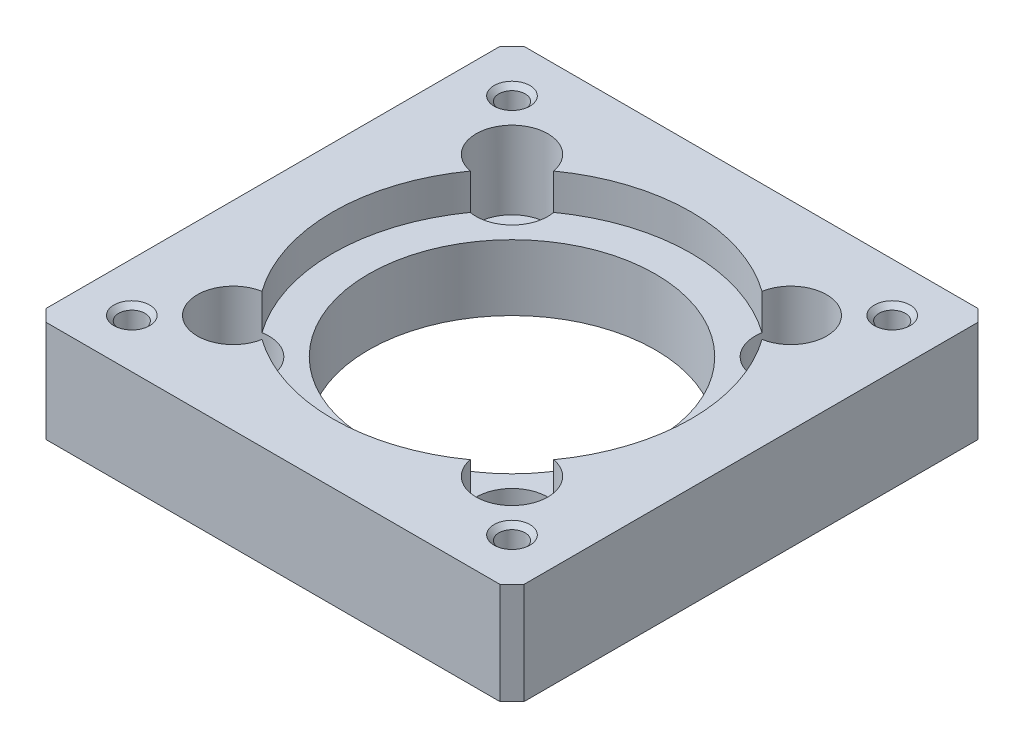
ISO-10303-21;
HEADER;
FILE_DESCRIPTION(('STEP AP214'),'2;1');
FILE_NAME('part.step','',(''),(''),'','','');
FILE_SCHEMA(('AUTOMOTIVE_DESIGN { 1 0 10303 214 1 1 1 1 }'));
ENDSEC;
DATA;
#1=APPLICATION_CONTEXT('core data for automotive mechanical design processes');
#2=APPLICATION_PROTOCOL_DEFINITION('international standard','automotive_design',2000,#1);
#3=PRODUCT_CONTEXT('',#1,'mechanical');
#4=PRODUCT('Part','Part','',(#3));
#5=PRODUCT_RELATED_PRODUCT_CATEGORY('part','',(#4));
#6=PRODUCT_DEFINITION_FORMATION('','',#4);
#7=PRODUCT_DEFINITION_CONTEXT('part definition',#1,'design');
#8=PRODUCT_DEFINITION('design','',#6,#7);
#9=PRODUCT_DEFINITION_SHAPE('','',#8);
#10=(LENGTH_UNIT() NAMED_UNIT(*) SI_UNIT(.MILLI.,.METRE.));
#11=(NAMED_UNIT(*) PLANE_ANGLE_UNIT() SI_UNIT($,.RADIAN.));
#12=(NAMED_UNIT(*) SI_UNIT($,.STERADIAN.) SOLID_ANGLE_UNIT());
#13=UNCERTAINTY_MEASURE_WITH_UNIT(LENGTH_MEASURE(1.E-05),#10,'distance_accuracy_value','');
#14=(GEOMETRIC_REPRESENTATION_CONTEXT(3) GLOBAL_UNCERTAINTY_ASSIGNED_CONTEXT((#13)) GLOBAL_UNIT_ASSIGNED_CONTEXT((#10,
#11,#12)) REPRESENTATION_CONTEXT('',''));
#15=CARTESIAN_POINT('',(0.,0.,0.));
#16=DIRECTION('',(0.,0.,1.));
#17=DIRECTION('',(1.,0.,0.));
#18=AXIS2_PLACEMENT_3D('',#15,#16,#17);
#19=CARTESIAN_POINT('',(-15.9099025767,8.10000000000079,15.9099025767));
#20=DIRECTION('',(0.,1.,0.));
#21=DIRECTION('',(0.,0.,1.));
#22=AXIS2_PLACEMENT_3D('',#19,#20,#21);
#23=CONICAL_SURFACE('',#22,1.09999999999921,0.785398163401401);
#24=CARTESIAN_POINT('',(-15.9099025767,8.1,15.9099025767));
#25=DIRECTION('',(0.,1.,0.));
#26=DIRECTION('',(1.,0.,0.));
#27=AXIS2_PLACEMENT_3D('',#24,#25,#26);
#28=CIRCLE('',#27,1.1);
#29=CARTESIAN_POINT('',(-14.8099025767,8.1,15.9099025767));
#30=VERTEX_POINT('',#29);
#31=EDGE_CURVE('E238',#30,#30,#28,.F.);
#32=ORIENTED_EDGE('',*,*,#31,.T.);
#33=EDGE_LOOP('',(#32));
#34=FACE_BOUND('',#33,.T.);
#35=CARTESIAN_POINT('',(-15.9099025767,8.49999999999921,15.9099025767));
#36=DIRECTION('',(0.,1.,0.));
#37=DIRECTION('',(0.,0.,1.));
#38=AXIS2_PLACEMENT_3D('',#35,#36,#37);
#39=CIRCLE('',#38,1.50000000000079);
#40=CARTESIAN_POINT('',(-15.9099025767,8.49999999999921,17.4099025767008));
#41=VERTEX_POINT('',#40);
#42=EDGE_CURVE('E266',#41,#41,#39,.T.);
#43=ORIENTED_EDGE('',*,*,#42,.T.);
#44=EDGE_LOOP('',(#43));
#45=FACE_BOUND('',#44,.T.);
#46=ADVANCED_FACE('F16',(#34,#45),#23,.F.);
#47=CARTESIAN_POINT('',(15.9099025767,8.10000000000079,15.9099025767));
#48=DIRECTION('',(0.,1.,0.));
#49=DIRECTION('',(0.,0.,1.));
#50=AXIS2_PLACEMENT_3D('',#47,#48,#49);
#51=CONICAL_SURFACE('',#50,1.09999999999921,0.785398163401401);
#52=CARTESIAN_POINT('',(15.9099025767,8.1,15.9099025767));
#53=DIRECTION('',(0.,1.,0.));
#54=DIRECTION('',(1.,0.,0.));
#55=AXIS2_PLACEMENT_3D('',#52,#53,#54);
#56=CIRCLE('',#55,1.1);
#57=CARTESIAN_POINT('',(17.0099025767,8.1,15.9099025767));
#58=VERTEX_POINT('',#57);
#59=EDGE_CURVE('E336',#58,#58,#56,.F.);
#60=ORIENTED_EDGE('',*,*,#59,.T.);
#61=EDGE_LOOP('',(#60));
#62=FACE_BOUND('',#61,.T.);
#63=CARTESIAN_POINT('',(15.9099025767,8.49999999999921,15.9099025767));
#64=DIRECTION('',(0.,1.,0.));
#65=DIRECTION('',(0.,0.,1.));
#66=AXIS2_PLACEMENT_3D('',#63,#64,#65);
#67=CIRCLE('',#66,1.5000000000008);
#68=CARTESIAN_POINT('',(15.9099025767,8.49999999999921,17.4099025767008));
#69=VERTEX_POINT('',#68);
#70=EDGE_CURVE('E263',#69,#69,#67,.T.);
#71=ORIENTED_EDGE('',*,*,#70,.T.);
#72=EDGE_LOOP('',(#71));
#73=FACE_BOUND('',#72,.T.);
#74=ADVANCED_FACE('F437',(#62,#73),#51,.F.);
#75=CARTESIAN_POINT('',(15.9099025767,8.10000000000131,-15.9099025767));
#76=DIRECTION('',(0.,1.,0.));
#77=DIRECTION('',(0.,0.,1.));
#78=AXIS2_PLACEMENT_3D('',#75,#76,#77);
#79=CONICAL_SURFACE('',#78,1.09999999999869,0.785398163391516);
#80=CARTESIAN_POINT('',(15.9099025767,8.1,-15.9099025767));
#81=DIRECTION('',(0.,1.,0.));
#82=DIRECTION('',(1.,0.,0.));
#83=AXIS2_PLACEMENT_3D('',#80,#81,#82);
#84=CIRCLE('',#83,1.1);
#85=CARTESIAN_POINT('',(17.0099025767,8.1,-15.9099025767));
#86=VERTEX_POINT('',#85);
#87=EDGE_CURVE('E333',#86,#86,#84,.F.);
#88=ORIENTED_EDGE('',*,*,#87,.T.);
#89=EDGE_LOOP('',(#88));
#90=FACE_BOUND('',#89,.T.);
#91=CARTESIAN_POINT('',(15.9099025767,8.50000000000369,-15.9099025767));
#92=DIRECTION('',(0.,1.,0.));
#93=DIRECTION('',(0.,0.,1.));
#94=AXIS2_PLACEMENT_3D('',#91,#92,#93);
#95=CIRCLE('',#94,1.49999999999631);
#96=CARTESIAN_POINT('',(15.9099025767,8.50000000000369,-14.4099025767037));
#97=VERTEX_POINT('',#96);
#98=EDGE_CURVE('E269',#97,#97,#95,.T.);
#99=ORIENTED_EDGE('',*,*,#98,.T.);
#100=EDGE_LOOP('',(#99));
#101=FACE_BOUND('',#100,.T.);
#102=ADVANCED_FACE('F441',(#90,#101),#79,.F.);
#103=CARTESIAN_POINT('',(-15.9099025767,8.10000000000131,-15.9099025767));
#104=DIRECTION('',(0.,1.,0.));
#105=DIRECTION('',(0.,0.,1.));
#106=AXIS2_PLACEMENT_3D('',#103,#104,#105);
#107=CONICAL_SURFACE('',#106,1.09999999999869,0.785398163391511);
#108=CARTESIAN_POINT('',(-15.9099025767,8.1,-15.9099025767));
#109=DIRECTION('',(0.,1.,0.));
#110=DIRECTION('',(1.,0.,0.));
#111=AXIS2_PLACEMENT_3D('',#108,#109,#110);
#112=CIRCLE('',#111,1.1);
#113=CARTESIAN_POINT('',(-14.8099025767,8.1,-15.9099025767));
#114=VERTEX_POINT('',#113);
#115=EDGE_CURVE('E234',#114,#114,#112,.F.);
#116=ORIENTED_EDGE('',*,*,#115,.T.);
#117=EDGE_LOOP('',(#116));
#118=FACE_BOUND('',#117,.T.);
#119=CARTESIAN_POINT('',(-15.9099025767,8.50000000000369,-15.9099025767));
#120=DIRECTION('',(0.,1.,0.));
#121=DIRECTION('',(0.,0.,1.));
#122=AXIS2_PLACEMENT_3D('',#119,#120,#121);
#123=CIRCLE('',#122,1.49999999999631);
#124=CARTESIAN_POINT('',(-15.9099025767,8.50000000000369,-14.4099025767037));
#125=VERTEX_POINT('',#124);
#126=EDGE_CURVE('E260',#125,#125,#123,.T.);
#127=ORIENTED_EDGE('',*,*,#126,.T.);
#128=EDGE_LOOP('',(#127));
#129=FACE_BOUND('',#128,.T.);
#130=ADVANCED_FACE('F445',(#118,#129),#107,.F.);
#131=CARTESIAN_POINT('',(0.,5.5,0.));
#132=DIRECTION('',(0.,1.,0.));
#133=DIRECTION('',(0.,0.,1.));
#134=AXIS2_PLACEMENT_3D('',#131,#132,#133);
#135=CYLINDRICAL_SURFACE('',#134,15.);
#136=CARTESIAN_POINT('',(0.,5.5,0.));
#137=DIRECTION('',(0.,1.,0.));
#138=DIRECTION('',(0.,0.,1.));
#139=AXIS2_PLACEMENT_3D('',#136,#137,#138);
#140=CIRCLE('',#139,15.);
#141=CARTESIAN_POINT('',(12.2076072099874,5.5,-8.71632526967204));
#142=VERTEX_POINT('',#141);
#143=CARTESIAN_POINT('',(12.2076072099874,5.5,8.71632526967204));
#144=VERTEX_POINT('',#143);
#145=EDGE_CURVE('E228',#142,#144,#140,.F.);
#146=ORIENTED_EDGE('',*,*,#145,.T.);
#147=DIRECTION('',(0.,-1.,0.));
#148=VECTOR('',#147,1.);
#149=CARTESIAN_POINT('',(12.2076072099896,5.25,8.71632526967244));
#150=LINE('',#149,#148);
#151=CARTESIAN_POINT('',(12.2076072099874,8.5,8.71632526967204));
#152=VERTEX_POINT('',#151);
#153=EDGE_CURVE('E324',#144,#152,#150,.F.);
#154=ORIENTED_EDGE('',*,*,#153,.T.);
#155=CARTESIAN_POINT('',(0.,8.5,0.));
#156=DIRECTION('',(0.,1.,0.));
#157=DIRECTION('',(0.,0.,1.));
#158=AXIS2_PLACEMENT_3D('',#155,#156,#157);
#159=CIRCLE('',#158,15.);
#160=CARTESIAN_POINT('',(12.2076072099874,8.5,-8.71632526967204));
#161=VERTEX_POINT('',#160);
#162=EDGE_CURVE('E257',#152,#161,#159,.T.);
#163=ORIENTED_EDGE('',*,*,#162,.T.);
#164=DIRECTION('',(0.,1.,0.));
#165=VECTOR('',#164,1.);
#166=CARTESIAN_POINT('',(12.2076072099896,5.25,-8.71632526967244));
#167=LINE('',#166,#165);
#168=EDGE_CURVE('E327',#161,#142,#167,.F.);
#169=ORIENTED_EDGE('',*,*,#168,.T.);
#170=EDGE_LOOP('',(#146,#154,#163,#169));
#171=FACE_BOUND('',#170,.T.);
#172=ADVANCED_FACE('F449',(#171),#135,.F.);
#173=CARTESIAN_POINT('',(0.,5.5,0.));
#174=DIRECTION('',(0.,1.,0.));
#175=DIRECTION('',(0.,0.,1.));
#176=AXIS2_PLACEMENT_3D('',#173,#174,#175);
#177=CYLINDRICAL_SURFACE('',#176,15.);
#178=CARTESIAN_POINT('',(0.,5.5,0.));
#179=DIRECTION('',(0.,1.,0.));
#180=DIRECTION('',(0.,0.,1.));
#181=AXIS2_PLACEMENT_3D('',#178,#179,#180);
#182=CIRCLE('',#181,15.);
#183=CARTESIAN_POINT('',(8.71632526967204,5.5,12.2076072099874));
#184=VERTEX_POINT('',#183);
#185=CARTESIAN_POINT('',(-8.71632526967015,5.5,12.2076072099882));
#186=VERTEX_POINT('',#185);
#187=EDGE_CURVE('E222',#184,#186,#182,.F.);
#188=ORIENTED_EDGE('',*,*,#187,.T.);
#189=DIRECTION('',(0.,-1.,0.));
#190=VECTOR('',#189,1.);
#191=CARTESIAN_POINT('',(-8.71632526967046,5.25,12.2076072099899));
#192=LINE('',#191,#190);
#193=CARTESIAN_POINT('',(-8.71632526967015,8.5,12.2076072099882));
#194=VERTEX_POINT('',#193);
#195=EDGE_CURVE('E314',#186,#194,#192,.F.);
#196=ORIENTED_EDGE('',*,*,#195,.T.);
#197=CARTESIAN_POINT('',(0.,8.5,0.));
#198=DIRECTION('',(0.,1.,0.));
#199=DIRECTION('',(0.,0.,1.));
#200=AXIS2_PLACEMENT_3D('',#197,#198,#199);
#201=CIRCLE('',#200,15.);
#202=CARTESIAN_POINT('',(8.71632526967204,8.5,12.2076072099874));
#203=VERTEX_POINT('',#202);
#204=EDGE_CURVE('E239',#194,#203,#201,.T.);
#205=ORIENTED_EDGE('',*,*,#204,.T.);
#206=DIRECTION('',(0.,1.,0.));
#207=VECTOR('',#206,1.);
#208=CARTESIAN_POINT('',(8.71632526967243,5.25,12.2076072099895));
#209=LINE('',#208,#207);
#210=EDGE_CURVE('E318',#203,#184,#209,.F.);
#211=ORIENTED_EDGE('',*,*,#210,.T.);
#212=EDGE_LOOP('',(#188,#196,#205,#211));
#213=FACE_BOUND('',#212,.T.);
#214=ADVANCED_FACE('F453',(#213),#177,.F.);
#215=CARTESIAN_POINT('',(0.,5.5,0.));
#216=DIRECTION('',(0.,1.,0.));
#217=DIRECTION('',(0.,0.,1.));
#218=AXIS2_PLACEMENT_3D('',#215,#216,#217);
#219=CYLINDRICAL_SURFACE('',#218,15.);
#220=CARTESIAN_POINT('',(0.,8.5,0.));
#221=DIRECTION('',(0.,1.,0.));
#222=DIRECTION('',(0.,0.,1.));
#223=AXIS2_PLACEMENT_3D('',#220,#221,#222);
#224=CIRCLE('',#223,15.);
#225=CARTESIAN_POINT('',(-12.2076072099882,8.5,-8.71632526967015));
#226=VERTEX_POINT('',#225);
#227=CARTESIAN_POINT('',(-12.2076072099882,8.5,8.71632526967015));
#228=VERTEX_POINT('',#227);
#229=EDGE_CURVE('E245',#226,#228,#224,.T.);
#230=ORIENTED_EDGE('',*,*,#229,.T.);
#231=DIRECTION('',(0.,1.,0.));
#232=VECTOR('',#231,1.);
#233=CARTESIAN_POINT('',(-12.2076072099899,5.25,8.71632526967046));
#234=LINE('',#233,#232);
#235=CARTESIAN_POINT('',(-12.2076072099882,5.5,8.71632526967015));
#236=VERTEX_POINT('',#235);
#237=EDGE_CURVE('E320',#228,#236,#234,.F.);
#238=ORIENTED_EDGE('',*,*,#237,.T.);
#239=CARTESIAN_POINT('',(0.,5.5,0.));
#240=DIRECTION('',(0.,1.,0.));
#241=DIRECTION('',(0.,0.,1.));
#242=AXIS2_PLACEMENT_3D('',#239,#240,#241);
#243=CIRCLE('',#242,15.);
#244=CARTESIAN_POINT('',(-12.2076072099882,5.5,-8.71632526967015));
#245=VERTEX_POINT('',#244);
#246=EDGE_CURVE('E216',#236,#245,#243,.F.);
#247=ORIENTED_EDGE('',*,*,#246,.T.);
#248=DIRECTION('',(0.,-1.,0.));
#249=VECTOR('',#248,1.);
#250=CARTESIAN_POINT('',(-12.2076072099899,5.25,-8.71632526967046));
#251=LINE('',#250,#249);
#252=EDGE_CURVE('E317',#245,#226,#251,.F.);
#253=ORIENTED_EDGE('',*,*,#252,.T.);
#254=EDGE_LOOP('',(#230,#238,#247,#253));
#255=FACE_BOUND('',#254,.T.);
#256=ADVANCED_FACE('F457',(#255),#219,.F.);
#257=CARTESIAN_POINT('',(0.,5.5,0.));
#258=DIRECTION('',(0.,1.,0.));
#259=DIRECTION('',(0.,0.,1.));
#260=AXIS2_PLACEMENT_3D('',#257,#258,#259);
#261=CYLINDRICAL_SURFACE('',#260,15.);
#262=CARTESIAN_POINT('',(0.,5.5,0.));
#263=DIRECTION('',(0.,1.,0.));
#264=DIRECTION('',(0.,0.,1.));
#265=AXIS2_PLACEMENT_3D('',#262,#263,#264);
#266=CIRCLE('',#265,15.);
#267=CARTESIAN_POINT('',(-8.71632526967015,5.5,-12.2076072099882));
#268=VERTEX_POINT('',#267);
#269=CARTESIAN_POINT('',(8.71632526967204,5.5,-12.2076072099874));
#270=VERTEX_POINT('',#269);
#271=EDGE_CURVE('E210',#268,#270,#266,.F.);
#272=ORIENTED_EDGE('',*,*,#271,.T.);
#273=DIRECTION('',(0.,-1.,0.));
#274=VECTOR('',#273,1.);
#275=CARTESIAN_POINT('',(8.71632526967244,5.25,-12.2076072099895));
#276=LINE('',#275,#274);
#277=CARTESIAN_POINT('',(8.71632526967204,8.5,-12.2076072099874));
#278=VERTEX_POINT('',#277);
#279=EDGE_CURVE('E329',#270,#278,#276,.F.);
#280=ORIENTED_EDGE('',*,*,#279,.T.);
#281=CARTESIAN_POINT('',(0.,8.5,0.));
#282=DIRECTION('',(0.,1.,0.));
#283=DIRECTION('',(0.,0.,1.));
#284=AXIS2_PLACEMENT_3D('',#281,#282,#283);
#285=CIRCLE('',#284,15.);
#286=CARTESIAN_POINT('',(-8.71632526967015,8.5,-12.2076072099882));
#287=VERTEX_POINT('',#286);
#288=EDGE_CURVE('E251',#278,#287,#285,.T.);
#289=ORIENTED_EDGE('',*,*,#288,.T.);
#290=DIRECTION('',(0.,1.,0.));
#291=VECTOR('',#290,1.);
#292=CARTESIAN_POINT('',(-8.71632526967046,5.25,-12.2076072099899));
#293=LINE('',#292,#291);
#294=EDGE_CURVE('E315',#287,#268,#293,.F.);
#295=ORIENTED_EDGE('',*,*,#294,.T.);
#296=EDGE_LOOP('',(#272,#280,#289,#295));
#297=FACE_BOUND('',#296,.T.);
#298=ADVANCED_FACE('F461',(#297),#261,.F.);
#299=CARTESIAN_POINT('',(11.66726188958,2.,-11.66726188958));
#300=DIRECTION('',(0.,1.,0.));
#301=DIRECTION('',(0.,0.,1.));
#302=AXIS2_PLACEMENT_3D('',#299,#300,#301);
#303=CYLINDRICAL_SURFACE('',#302,3.);
#304=CARTESIAN_POINT('',(11.66726188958,2.,-11.66726188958));
#305=DIRECTION('',(0.,1.,0.));
#306=DIRECTION('',(0.,0.,1.));
#307=AXIS2_PLACEMENT_3D('',#304,#305,#306);
#308=CIRCLE('',#307,3.);
#309=CARTESIAN_POINT('',(11.66726188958,2.,-8.66726188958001));
#310=VERTEX_POINT('',#309);
#311=EDGE_CURVE('E207',#310,#310,#308,.F.);
#312=ORIENTED_EDGE('',*,*,#311,.T.);
#313=EDGE_LOOP('',(#312));
#314=FACE_BOUND('',#313,.T.);
#315=ORIENTED_EDGE('',*,*,#168,.F.);
#316=CARTESIAN_POINT('',(11.66726188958,8.5,-11.66726188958));
#317=DIRECTION('',(0.,1.,0.));
#318=DIRECTION('',(0.,0.,1.));
#319=AXIS2_PLACEMENT_3D('',#316,#317,#318);
#320=CIRCLE('',#319,3.);
#321=EDGE_CURVE('E254',#161,#278,#320,.T.);
#322=ORIENTED_EDGE('',*,*,#321,.T.);
#323=ORIENTED_EDGE('',*,*,#279,.F.);
#324=CARTESIAN_POINT('',(11.66726188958,5.5,-11.66726188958));
#325=DIRECTION('',(0.,1.,0.));
#326=DIRECTION('',(0.,0.,1.));
#327=AXIS2_PLACEMENT_3D('',#324,#325,#326);
#328=CIRCLE('',#327,3.);
#329=EDGE_CURVE('E231',#270,#142,#328,.T.);
#330=ORIENTED_EDGE('',*,*,#329,.T.);
#331=EDGE_LOOP('',(#315,#322,#323,#330));
#332=FACE_BOUND('',#331,.T.);
#333=ADVANCED_FACE('F465',(#314,#332),#303,.F.);
#334=CARTESIAN_POINT('',(11.66726188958,2.,11.66726188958));
#335=DIRECTION('',(0.,1.,0.));
#336=DIRECTION('',(0.,0.,1.));
#337=AXIS2_PLACEMENT_3D('',#334,#335,#336);
#338=CYLINDRICAL_SURFACE('',#337,3.);
#339=CARTESIAN_POINT('',(11.66726188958,2.,11.66726188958));
#340=DIRECTION('',(0.,1.,0.));
#341=DIRECTION('',(0.,0.,1.));
#342=AXIS2_PLACEMENT_3D('',#339,#340,#341);
#343=CIRCLE('',#342,3.);
#344=CARTESIAN_POINT('',(11.66726188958,2.,14.66726188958));
#345=VERTEX_POINT('',#344);
#346=EDGE_CURVE('E204',#345,#345,#343,.F.);
#347=ORIENTED_EDGE('',*,*,#346,.T.);
#348=EDGE_LOOP('',(#347));
#349=FACE_BOUND('',#348,.T.);
#350=ORIENTED_EDGE('',*,*,#210,.F.);
#351=CARTESIAN_POINT('',(11.66726188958,8.5,11.66726188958));
#352=DIRECTION('',(0.,1.,0.));
#353=DIRECTION('',(0.,0.,1.));
#354=AXIS2_PLACEMENT_3D('',#351,#352,#353);
#355=CIRCLE('',#354,3.);
#356=EDGE_CURVE('E235',#203,#152,#355,.T.);
#357=ORIENTED_EDGE('',*,*,#356,.T.);
#358=ORIENTED_EDGE('',*,*,#153,.F.);
#359=CARTESIAN_POINT('',(11.66726188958,5.5,11.66726188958));
#360=DIRECTION('',(0.,1.,0.));
#361=DIRECTION('',(0.,0.,1.));
#362=AXIS2_PLACEMENT_3D('',#359,#360,#361);
#363=CIRCLE('',#362,3.);
#364=EDGE_CURVE('E225',#144,#184,#363,.T.);
#365=ORIENTED_EDGE('',*,*,#364,.T.);
#366=EDGE_LOOP('',(#350,#357,#358,#365));
#367=FACE_BOUND('',#366,.T.);
#368=ADVANCED_FACE('F469',(#349,#367),#338,.F.);
#369=CARTESIAN_POINT('',(-11.66726188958,2.,-11.66726188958));
#370=DIRECTION('',(0.,1.,0.));
#371=DIRECTION('',(0.,0.,1.));
#372=AXIS2_PLACEMENT_3D('',#369,#370,#371);
#373=CYLINDRICAL_SURFACE('',#372,3.000000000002);
#374=CARTESIAN_POINT('',(-11.66726188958,2.,-11.66726188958));
#375=DIRECTION('',(0.,1.,0.));
#376=DIRECTION('',(0.,0.,1.));
#377=AXIS2_PLACEMENT_3D('',#374,#375,#376);
#378=CIRCLE('',#377,3.000000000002);
#379=CARTESIAN_POINT('',(-11.66726188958,2.,-8.667261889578));
#380=VERTEX_POINT('',#379);
#381=EDGE_CURVE('E152',#380,#380,#378,.F.);
#382=ORIENTED_EDGE('',*,*,#381,.T.);
#383=EDGE_LOOP('',(#382));
#384=FACE_BOUND('',#383,.T.);
#385=ORIENTED_EDGE('',*,*,#294,.F.);
#386=CARTESIAN_POINT('',(-11.66726188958,8.5,-11.66726188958));
#387=DIRECTION('',(0.,1.,0.));
#388=DIRECTION('',(0.,0.,1.));
#389=AXIS2_PLACEMENT_3D('',#386,#387,#388);
#390=CIRCLE('',#389,3.000000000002);
#391=EDGE_CURVE('E248',#287,#226,#390,.T.);
#392=ORIENTED_EDGE('',*,*,#391,.T.);
#393=ORIENTED_EDGE('',*,*,#252,.F.);
#394=CARTESIAN_POINT('',(-11.66726188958,5.5,-11.66726188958));
#395=DIRECTION('',(0.,1.,0.));
#396=DIRECTION('',(0.,0.,1.));
#397=AXIS2_PLACEMENT_3D('',#394,#395,#396);
#398=CIRCLE('',#397,3.000000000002);
#399=EDGE_CURVE('E213',#245,#268,#398,.T.);
#400=ORIENTED_EDGE('',*,*,#399,.T.);
#401=EDGE_LOOP('',(#385,#392,#393,#400));
#402=FACE_BOUND('',#401,.T.);
#403=ADVANCED_FACE('F473',(#384,#402),#373,.F.);
#404=CARTESIAN_POINT('',(-11.66726188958,2.,11.66726188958));
#405=DIRECTION('',(0.,1.,0.));
#406=DIRECTION('',(0.,0.,1.));
#407=AXIS2_PLACEMENT_3D('',#404,#405,#406);
#408=CYLINDRICAL_SURFACE('',#407,3.000000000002);
#409=CARTESIAN_POINT('',(-11.66726188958,2.,11.66726188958));
#410=DIRECTION('',(0.,1.,0.));
#411=DIRECTION('',(0.,0.,1.));
#412=AXIS2_PLACEMENT_3D('',#409,#410,#411);
#413=CIRCLE('',#412,3.000000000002);
#414=CARTESIAN_POINT('',(-11.66726188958,2.,14.667261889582));
#415=VERTEX_POINT('',#414);
#416=EDGE_CURVE('E149',#415,#415,#413,.F.);
#417=ORIENTED_EDGE('',*,*,#416,.T.);
#418=EDGE_LOOP('',(#417));
#419=FACE_BOUND('',#418,.T.);
#420=ORIENTED_EDGE('',*,*,#237,.F.);
#421=CARTESIAN_POINT('',(-11.66726188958,8.5,11.66726188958));
#422=DIRECTION('',(0.,1.,0.));
#423=DIRECTION('',(0.,0.,1.));
#424=AXIS2_PLACEMENT_3D('',#421,#422,#423);
#425=CIRCLE('',#424,3.000000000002);
#426=EDGE_CURVE('E242',#228,#194,#425,.T.);
#427=ORIENTED_EDGE('',*,*,#426,.T.);
#428=ORIENTED_EDGE('',*,*,#195,.F.);
#429=CARTESIAN_POINT('',(-11.66726188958,5.5,11.66726188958));
#430=DIRECTION('',(0.,1.,0.));
#431=DIRECTION('',(0.,0.,1.));
#432=AXIS2_PLACEMENT_3D('',#429,#430,#431);
#433=CIRCLE('',#432,3.000000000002);
#434=EDGE_CURVE('E219',#186,#236,#433,.T.);
#435=ORIENTED_EDGE('',*,*,#434,.T.);
#436=EDGE_LOOP('',(#420,#427,#428,#435));
#437=FACE_BOUND('',#436,.T.);
#438=ADVANCED_FACE('F434',(#419,#437),#408,.F.);
#439=CARTESIAN_POINT('',(-20.0528,8.67,-18.9472));
#440=DIRECTION('',(-0.707106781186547,0.,-0.707106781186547));
#441=DIRECTION('',(0.707106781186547,0.,-0.707106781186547));
#442=AXIS2_PLACEMENT_3D('',#439,#440,#441);
#443=PLANE('',#442);
#444=DIRECTION('',(0.707106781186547,0.,-0.707106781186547));
#445=VECTOR('',#444,1.);
#446=CARTESIAN_POINT('',(-20.0528,8.5,-18.9472));
#447=LINE('',#446,#445);
#448=CARTESIAN_POINT('',(-20.,8.5,-19.));
#449=VERTEX_POINT('',#448);
#450=CARTESIAN_POINT('',(-19.,8.5,-20.));
#451=VERTEX_POINT('',#450);
#452=EDGE_CURVE('E272',#449,#451,#447,.T.);
#453=ORIENTED_EDGE('',*,*,#452,.T.);
#454=DIRECTION('',(0.,1.,0.));
#455=VECTOR('',#454,1.);
#456=CARTESIAN_POINT('',(-19.,4.25,-20.));
#457=LINE('',#456,#455);
#458=CARTESIAN_POINT('',(-19.,0.,-20.));
#459=VERTEX_POINT('',#458);
#460=EDGE_CURVE('E145',#451,#459,#457,.F.);
#461=ORIENTED_EDGE('',*,*,#460,.T.);
#462=DIRECTION('',(-0.707106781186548,0.,0.707106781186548));
#463=VECTOR('',#462,1.);
#464=CARTESIAN_POINT('',(-19.5,0.,-19.5));
#465=LINE('',#464,#463);
#466=CARTESIAN_POINT('',(-20.,0.,-19.));
#467=VERTEX_POINT('',#466);
#468=EDGE_CURVE('E312',#467,#459,#465,.F.);
#469=ORIENTED_EDGE('',*,*,#468,.F.);
#470=DIRECTION('',(0.,-1.,0.));
#471=VECTOR('',#470,1.);
#472=CARTESIAN_POINT('',(-20.,4.25,-19.));
#473=LINE('',#472,#471);
#474=EDGE_CURVE('E342',#467,#449,#473,.F.);
#475=ORIENTED_EDGE('',*,*,#474,.T.);
#476=EDGE_LOOP('',(#453,#461,#469,#475));
#477=FACE_BOUND('',#476,.T.);
#478=ADVANCED_FACE('F345',(#477),#443,.T.);
#479=CARTESIAN_POINT('',(-18.9472,8.67,20.0528));
#480=DIRECTION('',(-0.707106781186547,0.,0.707106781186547));
#481=DIRECTION('',(-0.707106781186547,0.,-0.707106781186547));
#482=AXIS2_PLACEMENT_3D('',#479,#480,#481);
#483=PLANE('',#482);
#484=DIRECTION('',(-0.707106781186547,0.,-0.707106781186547));
#485=VECTOR('',#484,1.);
#486=CARTESIAN_POINT('',(-18.9472,8.5,20.0528));
#487=LINE('',#486,#485);
#488=CARTESIAN_POINT('',(-19.,8.5,20.));
#489=VERTEX_POINT('',#488);
#490=CARTESIAN_POINT('',(-20.,8.5,19.));
#491=VERTEX_POINT('',#490);
#492=EDGE_CURVE('E274',#489,#491,#487,.T.);
#493=ORIENTED_EDGE('',*,*,#492,.T.);
#494=DIRECTION('',(0.,1.,0.));
#495=VECTOR('',#494,1.);
#496=CARTESIAN_POINT('',(-20.,4.25,19.));
#497=LINE('',#496,#495);
#498=CARTESIAN_POINT('',(-20.,0.,19.));
#499=VERTEX_POINT('',#498);
#500=EDGE_CURVE('E290',#491,#499,#497,.F.);
#501=ORIENTED_EDGE('',*,*,#500,.T.);
#502=DIRECTION('',(0.707106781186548,0.,0.707106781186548));
#503=VECTOR('',#502,1.);
#504=CARTESIAN_POINT('',(-19.5,0.,19.5));
#505=LINE('',#504,#503);
#506=CARTESIAN_POINT('',(-19.,0.,20.));
#507=VERTEX_POINT('',#506);
#508=EDGE_CURVE('E310',#507,#499,#505,.F.);
#509=ORIENTED_EDGE('',*,*,#508,.F.);
#510=DIRECTION('',(0.,-1.,0.));
#511=VECTOR('',#510,1.);
#512=CARTESIAN_POINT('',(-19.,4.25,20.));
#513=LINE('',#512,#511);
#514=EDGE_CURVE('E288',#507,#489,#513,.F.);
#515=ORIENTED_EDGE('',*,*,#514,.T.);
#516=EDGE_LOOP('',(#493,#501,#509,#515));
#517=FACE_BOUND('',#516,.T.);
#518=ADVANCED_FACE('F428',(#517),#483,.T.);
#519=CARTESIAN_POINT('',(18.9472,8.67,-20.0528));
#520=DIRECTION('',(0.707106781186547,0.,-0.707106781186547));
#521=DIRECTION('',(0.707106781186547,0.,0.707106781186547));
#522=AXIS2_PLACEMENT_3D('',#519,#520,#521);
#523=PLANE('',#522);
#524=DIRECTION('',(0.707106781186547,0.,0.707106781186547));
#525=VECTOR('',#524,1.);
#526=CARTESIAN_POINT('',(18.9472,8.5,-20.0528));
#527=LINE('',#526,#525);
#528=CARTESIAN_POINT('',(19.,8.5,-20.));
#529=VERTEX_POINT('',#528);
#530=CARTESIAN_POINT('',(20.,8.5,-19.));
#531=VERTEX_POINT('',#530);
#532=EDGE_CURVE('E20',#529,#531,#527,.T.);
#533=ORIENTED_EDGE('',*,*,#532,.T.);
#534=DIRECTION('',(0.,1.,0.));
#535=VECTOR('',#534,1.);
#536=CARTESIAN_POINT('',(20.,4.25,-19.));
#537=LINE('',#536,#535);
#538=CARTESIAN_POINT('',(20.,0.,-19.));
#539=VERTEX_POINT('',#538);
#540=EDGE_CURVE('E158',#531,#539,#537,.F.);
#541=ORIENTED_EDGE('',*,*,#540,.T.);
#542=DIRECTION('',(-0.707106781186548,0.,-0.707106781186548));
#543=VECTOR('',#542,1.);
#544=CARTESIAN_POINT('',(19.5,0.,-19.5));
#545=LINE('',#544,#543);
#546=CARTESIAN_POINT('',(19.,0.,-20.));
#547=VERTEX_POINT('',#546);
#548=EDGE_CURVE('E148',#547,#539,#545,.F.);
#549=ORIENTED_EDGE('',*,*,#548,.F.);
#550=DIRECTION('',(0.,-1.,0.));
#551=VECTOR('',#550,1.);
#552=CARTESIAN_POINT('',(19.,4.25,-20.));
#553=LINE('',#552,#551);
#554=EDGE_CURVE('E142',#547,#529,#553,.F.);
#555=ORIENTED_EDGE('',*,*,#554,.T.);
#556=EDGE_LOOP('',(#533,#541,#549,#555));
#557=FACE_BOUND('',#556,.T.);
#558=ADVANCED_FACE('F147',(#557),#523,.T.);
#559=CARTESIAN_POINT('',(20.0528,8.67,18.9472));
#560=DIRECTION('',(0.707106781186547,0.,0.707106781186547));
#561=DIRECTION('',(-0.707106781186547,0.,0.707106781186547));
#562=AXIS2_PLACEMENT_3D('',#559,#560,#561);
#563=PLANE('',#562);
#564=DIRECTION('',(-0.707106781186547,0.,0.707106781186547));
#565=VECTOR('',#564,1.);
#566=CARTESIAN_POINT('',(20.0528,8.5,18.9472));
#567=LINE('',#566,#565);
#568=CARTESIAN_POINT('',(20.,8.5,19.));
#569=VERTEX_POINT('',#568);
#570=CARTESIAN_POINT('',(19.,8.5,20.));
#571=VERTEX_POINT('',#570);
#572=EDGE_CURVE('E136',#569,#571,#567,.T.);
#573=ORIENTED_EDGE('',*,*,#572,.T.);
#574=DIRECTION('',(0.,1.,0.));
#575=VECTOR('',#574,1.);
#576=CARTESIAN_POINT('',(19.,4.25,20.));
#577=LINE('',#576,#575);
#578=CARTESIAN_POINT('',(19.,0.,20.));
#579=VERTEX_POINT('',#578);
#580=EDGE_CURVE('E156',#571,#579,#577,.F.);
#581=ORIENTED_EDGE('',*,*,#580,.T.);
#582=DIRECTION('',(0.707106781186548,0.,-0.707106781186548));
#583=VECTOR('',#582,1.);
#584=CARTESIAN_POINT('',(19.5,0.,19.5));
#585=LINE('',#584,#583);
#586=CARTESIAN_POINT('',(20.,0.,19.));
#587=VERTEX_POINT('',#586);
#588=EDGE_CURVE('E35',#587,#579,#585,.F.);
#589=ORIENTED_EDGE('',*,*,#588,.F.);
#590=DIRECTION('',(0.,-1.,0.));
#591=VECTOR('',#590,1.);
#592=CARTESIAN_POINT('',(20.,4.25,19.));
#593=LINE('',#592,#591);
#594=EDGE_CURVE('E159',#587,#569,#593,.F.);
#595=ORIENTED_EDGE('',*,*,#594,.T.);
#596=EDGE_LOOP('',(#573,#581,#589,#595));
#597=FACE_BOUND('',#596,.T.);
#598=ADVANCED_FACE('F276',(#597),#563,.T.);
#599=CARTESIAN_POINT('',(-20.8,8.5,20.8));
#600=DIRECTION('',(0.,1.,0.));
#601=DIRECTION('',(1.,0.,0.));
#602=AXIS2_PLACEMENT_3D('',#599,#600,#601);
#603=PLANE('',#602);
#604=ORIENTED_EDGE('',*,*,#356,.F.);
#605=ORIENTED_EDGE('',*,*,#204,.F.);
#606=ORIENTED_EDGE('',*,*,#426,.F.);
#607=ORIENTED_EDGE('',*,*,#229,.F.);
#608=ORIENTED_EDGE('',*,*,#391,.F.);
#609=ORIENTED_EDGE('',*,*,#288,.F.);
#610=ORIENTED_EDGE('',*,*,#321,.F.);
#611=ORIENTED_EDGE('',*,*,#162,.F.);
#612=EDGE_LOOP('',(#604,#605,#606,#607,#608,#609,#610,#611));
#613=FACE_BOUND('',#612,.T.);
#614=ORIENTED_EDGE('',*,*,#126,.F.);
#615=EDGE_LOOP('',(#614));
#616=FACE_BOUND('',#615,.T.);
#617=ORIENTED_EDGE('',*,*,#70,.F.);
#618=EDGE_LOOP('',(#617));
#619=FACE_BOUND('',#618,.T.);
#620=ORIENTED_EDGE('',*,*,#42,.F.);
#621=EDGE_LOOP('',(#620));
#622=FACE_BOUND('',#621,.T.);
#623=ORIENTED_EDGE('',*,*,#98,.F.);
#624=EDGE_LOOP('',(#623));
#625=FACE_BOUND('',#624,.T.);
#626=ORIENTED_EDGE('',*,*,#452,.F.);
#627=DIRECTION('',(0.,0.,-1.));
#628=VECTOR('',#627,1.);
#629=CARTESIAN_POINT('',(-20.,8.5,0.));
#630=LINE('',#629,#628);
#631=EDGE_CURVE('E296',#449,#491,#630,.F.);
#632=ORIENTED_EDGE('',*,*,#631,.T.);
#633=ORIENTED_EDGE('',*,*,#492,.F.);
#634=DIRECTION('',(-1.,0.,0.));
#635=VECTOR('',#634,1.);
#636=CARTESIAN_POINT('',(0.,8.5,20.));
#637=LINE('',#636,#635);
#638=EDGE_CURVE('E283',#489,#571,#637,.F.);
#639=ORIENTED_EDGE('',*,*,#638,.T.);
#640=ORIENTED_EDGE('',*,*,#572,.F.);
#641=DIRECTION('',(0.,0.,1.));
#642=VECTOR('',#641,1.);
#643=CARTESIAN_POINT('',(20.,8.5,0.));
#644=LINE('',#643,#642);
#645=EDGE_CURVE('E132',#569,#531,#644,.F.);
#646=ORIENTED_EDGE('',*,*,#645,.T.);
#647=ORIENTED_EDGE('',*,*,#532,.F.);
#648=DIRECTION('',(1.,0.,0.));
#649=VECTOR('',#648,1.);
#650=CARTESIAN_POINT('',(0.,8.5,-20.));
#651=LINE('',#650,#649);
#652=EDGE_CURVE('E130',#529,#451,#651,.F.);
#653=ORIENTED_EDGE('',*,*,#652,.T.);
#654=EDGE_LOOP('',(#626,#632,#633,#639,#640,#646,#647,#653));
#655=FACE_BOUND('',#654,.T.);
#656=ADVANCED_FACE('F129',(#613,#616,#619,#622,#625,#655),#603,.T.);
#657=CARTESIAN_POINT('',(-15.9099025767,0.399999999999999,15.9099025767));
#658=DIRECTION('',(0.,1.,0.));
#659=DIRECTION('',(0.,0.,1.));
#660=AXIS2_PLACEMENT_3D('',#657,#658,#659);
#661=CYLINDRICAL_SURFACE('',#660,1.1);
#662=CARTESIAN_POINT('',(-15.9099025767,0.399999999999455,15.9099025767));
#663=DIRECTION('',(0.,-1.,0.));
#664=DIRECTION('',(0.,0.,-1.));
#665=AXIS2_PLACEMENT_3D('',#662,#663,#664);
#666=CIRCLE('',#665,1.09999999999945);
#667=CARTESIAN_POINT('',(-15.9099025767,0.399999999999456,14.8099025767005));
#668=VERTEX_POINT('',#667);
#669=EDGE_CURVE('E297',#668,#668,#666,.T.);
#670=ORIENTED_EDGE('',*,*,#669,.T.);
#671=EDGE_LOOP('',(#670));
#672=FACE_BOUND('',#671,.T.);
#673=ORIENTED_EDGE('',*,*,#31,.F.);
#674=EDGE_LOOP('',(#673));
#675=FACE_BOUND('',#674,.T.);
#676=ADVANCED_FACE('F422',(#672,#675),#661,.F.);
#677=CARTESIAN_POINT('',(15.9099025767,0.399999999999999,15.9099025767));
#678=DIRECTION('',(0.,1.,0.));
#679=DIRECTION('',(0.,0.,1.));
#680=AXIS2_PLACEMENT_3D('',#677,#678,#679);
#681=CYLINDRICAL_SURFACE('',#680,1.1);
#682=CARTESIAN_POINT('',(15.9099025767,0.399999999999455,15.9099025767));
#683=DIRECTION('',(0.,-1.,0.));
#684=DIRECTION('',(0.,0.,-1.));
#685=AXIS2_PLACEMENT_3D('',#682,#683,#684);
#686=CIRCLE('',#685,1.09999999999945);
#687=CARTESIAN_POINT('',(15.9099025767,0.399999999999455,14.8099025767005));
#688=VERTEX_POINT('',#687);
#689=EDGE_CURVE('E299',#688,#688,#686,.T.);
#690=ORIENTED_EDGE('',*,*,#689,.T.);
#691=EDGE_LOOP('',(#690));
#692=FACE_BOUND('',#691,.T.);
#693=ORIENTED_EDGE('',*,*,#59,.F.);
#694=EDGE_LOOP('',(#693));
#695=FACE_BOUND('',#694,.T.);
#696=ADVANCED_FACE('F483',(#692,#695),#681,.F.);
#697=CARTESIAN_POINT('',(15.9099025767,0.399999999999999,-15.9099025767));
#698=DIRECTION('',(0.,1.,0.));
#699=DIRECTION('',(0.,0.,1.));
#700=AXIS2_PLACEMENT_3D('',#697,#698,#699);
#701=CYLINDRICAL_SURFACE('',#700,1.1);
#702=CARTESIAN_POINT('',(15.9099025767,0.399999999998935,-15.9099025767));
#703=DIRECTION('',(0.,-1.,0.));
#704=DIRECTION('',(0.,0.,-1.));
#705=AXIS2_PLACEMENT_3D('',#702,#703,#704);
#706=CIRCLE('',#705,1.09999999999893);
#707=CARTESIAN_POINT('',(15.9099025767,0.399999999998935,-17.0099025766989));
#708=VERTEX_POINT('',#707);
#709=EDGE_CURVE('E304',#708,#708,#706,.T.);
#710=ORIENTED_EDGE('',*,*,#709,.T.);
#711=EDGE_LOOP('',(#710));
#712=FACE_BOUND('',#711,.T.);
#713=ORIENTED_EDGE('',*,*,#87,.F.);
#714=EDGE_LOOP('',(#713));
#715=FACE_BOUND('',#714,.T.);
#716=ADVANCED_FACE('F358',(#712,#715),#701,.F.);
#717=CARTESIAN_POINT('',(-15.9099025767,0.399999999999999,-15.9099025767));
#718=DIRECTION('',(0.,1.,0.));
#719=DIRECTION('',(0.,0.,1.));
#720=AXIS2_PLACEMENT_3D('',#717,#718,#719);
#721=CYLINDRICAL_SURFACE('',#720,1.1);
#722=CARTESIAN_POINT('',(-15.9099025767,0.399999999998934,-15.9099025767));
#723=DIRECTION('',(0.,-1.,0.));
#724=DIRECTION('',(0.,0.,-1.));
#725=AXIS2_PLACEMENT_3D('',#722,#723,#724);
#726=CIRCLE('',#725,1.09999999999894);
#727=CARTESIAN_POINT('',(-15.9099025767,0.399999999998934,-17.0099025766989));
#728=VERTEX_POINT('',#727);
#729=EDGE_CURVE('E200',#728,#728,#726,.T.);
#730=ORIENTED_EDGE('',*,*,#729,.T.);
#731=EDGE_LOOP('',(#730));
#732=FACE_BOUND('',#731,.T.);
#733=ORIENTED_EDGE('',*,*,#115,.F.);
#734=EDGE_LOOP('',(#733));
#735=FACE_BOUND('',#734,.T.);
#736=ADVANCED_FACE('F418',(#732,#735),#721,.F.);
#737=CARTESIAN_POINT('',(-15.61093206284,5.5,15.61092929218));
#738=DIRECTION('',(0.,1.,0.));
#739=DIRECTION('',(1.,0.,0.));
#740=AXIS2_PLACEMENT_3D('',#737,#738,#739);
#741=PLANE('',#740);
#742=CARTESIAN_POINT('',(0.,5.5,0.));
#743=DIRECTION('',(0.,1.,0.));
#744=DIRECTION('',(0.,0.,1.));
#745=AXIS2_PLACEMENT_3D('',#742,#743,#744);
#746=CIRCLE('',#745,12.);
#747=CARTESIAN_POINT('',(0.,5.5,12.));
#748=VERTEX_POINT('',#747);
#749=EDGE_CURVE('E198',#748,#748,#746,.F.);
#750=ORIENTED_EDGE('',*,*,#749,.T.);
#751=EDGE_LOOP('',(#750));
#752=FACE_BOUND('',#751,.T.);
#753=ORIENTED_EDGE('',*,*,#399,.F.);
#754=ORIENTED_EDGE('',*,*,#246,.F.);
#755=ORIENTED_EDGE('',*,*,#434,.F.);
#756=ORIENTED_EDGE('',*,*,#187,.F.);
#757=ORIENTED_EDGE('',*,*,#364,.F.);
#758=ORIENTED_EDGE('',*,*,#145,.F.);
#759=ORIENTED_EDGE('',*,*,#329,.F.);
#760=ORIENTED_EDGE('',*,*,#271,.F.);
#761=EDGE_LOOP('',(#753,#754,#755,#756,#757,#758,#759,#760));
#762=FACE_BOUND('',#761,.T.);
#763=ADVANCED_FACE('F414',(#752,#762),#741,.T.);
#764=CARTESIAN_POINT('',(-15.25395236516,2.,15.25395236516));
#765=DIRECTION('',(0.,1.,0.));
#766=DIRECTION('',(1.,0.,0.));
#767=AXIS2_PLACEMENT_3D('',#764,#765,#766);
#768=PLANE('',#767);
#769=CARTESIAN_POINT('',(11.66726188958,2.,-11.66726188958));
#770=DIRECTION('',(0.,1.,0.));
#771=DIRECTION('',(0.,0.,1.));
#772=AXIS2_PLACEMENT_3D('',#769,#770,#771);
#773=CIRCLE('',#772,1.75);
#774=CARTESIAN_POINT('',(11.66726188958,2.,-9.91726188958));
#775=VERTEX_POINT('',#774);
#776=EDGE_CURVE('E195',#775,#775,#773,.F.);
#777=ORIENTED_EDGE('',*,*,#776,.T.);
#778=EDGE_LOOP('',(#777));
#779=FACE_BOUND('',#778,.T.);
#780=ORIENTED_EDGE('',*,*,#311,.F.);
#781=EDGE_LOOP('',(#780));
#782=FACE_BOUND('',#781,.T.);
#783=ADVANCED_FACE('F410',(#779,#782),#768,.T.);
#784=CARTESIAN_POINT('',(-15.25395236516,2.,15.25395236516));
#785=DIRECTION('',(0.,1.,0.));
#786=DIRECTION('',(1.,0.,0.));
#787=AXIS2_PLACEMENT_3D('',#784,#785,#786);
#788=PLANE('',#787);
#789=CARTESIAN_POINT('',(11.66726188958,2.,11.66726188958));
#790=DIRECTION('',(0.,1.,0.));
#791=DIRECTION('',(0.,0.,1.));
#792=AXIS2_PLACEMENT_3D('',#789,#790,#791);
#793=CIRCLE('',#792,1.75);
#794=CARTESIAN_POINT('',(11.66726188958,2.,13.41726188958));
#795=VERTEX_POINT('',#794);
#796=EDGE_CURVE('E192',#795,#795,#793,.F.);
#797=ORIENTED_EDGE('',*,*,#796,.T.);
#798=EDGE_LOOP('',(#797));
#799=FACE_BOUND('',#798,.T.);
#800=ORIENTED_EDGE('',*,*,#346,.F.);
#801=EDGE_LOOP('',(#800));
#802=FACE_BOUND('',#801,.T.);
#803=ADVANCED_FACE('F406',(#799,#802),#788,.T.);
#804=CARTESIAN_POINT('',(-15.25395236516,2.,15.25395236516));
#805=DIRECTION('',(0.,1.,0.));
#806=DIRECTION('',(1.,0.,0.));
#807=AXIS2_PLACEMENT_3D('',#804,#805,#806);
#808=PLANE('',#807);
#809=CARTESIAN_POINT('',(-11.66726188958,2.,-11.66726188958));
#810=DIRECTION('',(0.,1.,0.));
#811=DIRECTION('',(0.,0.,1.));
#812=AXIS2_PLACEMENT_3D('',#809,#810,#811);
#813=CIRCLE('',#812,1.750000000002);
#814=CARTESIAN_POINT('',(-11.66726188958,2.,-9.917261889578));
#815=VERTEX_POINT('',#814);
#816=EDGE_CURVE('E189',#815,#815,#813,.F.);
#817=ORIENTED_EDGE('',*,*,#816,.T.);
#818=EDGE_LOOP('',(#817));
#819=FACE_BOUND('',#818,.T.);
#820=ORIENTED_EDGE('',*,*,#381,.F.);
#821=EDGE_LOOP('',(#820));
#822=FACE_BOUND('',#821,.T.);
#823=ADVANCED_FACE('F402',(#819,#822),#808,.T.);
#824=CARTESIAN_POINT('',(-15.25395236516,2.,15.25395236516));
#825=DIRECTION('',(0.,1.,0.));
#826=DIRECTION('',(1.,0.,0.));
#827=AXIS2_PLACEMENT_3D('',#824,#825,#826);
#828=PLANE('',#827);
#829=CARTESIAN_POINT('',(-11.66726188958,2.,11.66726188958));
#830=DIRECTION('',(0.,1.,0.));
#831=DIRECTION('',(0.,0.,1.));
#832=AXIS2_PLACEMENT_3D('',#829,#830,#831);
#833=CIRCLE('',#832,1.750000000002);
#834=CARTESIAN_POINT('',(-11.66726188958,2.,13.417261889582));
#835=VERTEX_POINT('',#834);
#836=EDGE_CURVE('E185',#835,#835,#833,.F.);
#837=ORIENTED_EDGE('',*,*,#836,.T.);
#838=EDGE_LOOP('',(#837));
#839=FACE_BOUND('',#838,.T.);
#840=ORIENTED_EDGE('',*,*,#416,.F.);
#841=EDGE_LOOP('',(#840));
#842=FACE_BOUND('',#841,.T.);
#843=ADVANCED_FACE('F399',(#839,#842),#828,.T.);
#844=CARTESIAN_POINT('',(19.76,-0.17,-20.));
#845=DIRECTION('',(0.,0.,-1.));
#846=DIRECTION('',(-1.,0.,0.));
#847=AXIS2_PLACEMENT_3D('',#844,#845,#846);
#848=PLANE('',#847);
#849=ORIENTED_EDGE('',*,*,#460,.F.);
#850=ORIENTED_EDGE('',*,*,#652,.F.);
#851=ORIENTED_EDGE('',*,*,#554,.F.);
#852=DIRECTION('',(-1.,0.,0.));
#853=VECTOR('',#852,1.);
#854=CARTESIAN_POINT('',(0.,0.,-20.));
#855=LINE('',#854,#853);
#856=EDGE_CURVE('E188',#547,#459,#855,.T.);
#857=ORIENTED_EDGE('',*,*,#856,.T.);
#858=EDGE_LOOP('',(#849,#850,#851,#857));
#859=FACE_BOUND('',#858,.T.);
#860=ADVANCED_FACE('F140',(#859),#848,.T.);
#861=CARTESIAN_POINT('',(-20.,-0.17,-19.76));
#862=DIRECTION('',(-1.,0.,0.));
#863=DIRECTION('',(0.,0.,1.));
#864=AXIS2_PLACEMENT_3D('',#861,#862,#863);
#865=PLANE('',#864);
#866=ORIENTED_EDGE('',*,*,#500,.F.);
#867=ORIENTED_EDGE('',*,*,#631,.F.);
#868=ORIENTED_EDGE('',*,*,#474,.F.);
#869=DIRECTION('',(0.,0.,1.));
#870=VECTOR('',#869,1.);
#871=CARTESIAN_POINT('',(-20.,0.,0.));
#872=LINE('',#871,#870);
#873=EDGE_CURVE('E348',#467,#499,#872,.T.);
#874=ORIENTED_EDGE('',*,*,#873,.T.);
#875=EDGE_LOOP('',(#866,#867,#868,#874));
#876=FACE_BOUND('',#875,.T.);
#877=ADVANCED_FACE('F391',(#876),#865,.T.);
#878=CARTESIAN_POINT('',(-19.76,-0.17,20.));
#879=DIRECTION('',(0.,0.,1.));
#880=DIRECTION('',(1.,0.,0.));
#881=AXIS2_PLACEMENT_3D('',#878,#879,#880);
#882=PLANE('',#881);
#883=ORIENTED_EDGE('',*,*,#580,.F.);
#884=ORIENTED_EDGE('',*,*,#638,.F.);
#885=ORIENTED_EDGE('',*,*,#514,.F.);
#886=DIRECTION('',(1.,0.,0.));
#887=VECTOR('',#886,1.);
#888=CARTESIAN_POINT('',(0.,0.,20.));
#889=LINE('',#888,#887);
#890=EDGE_CURVE('E286',#507,#579,#889,.T.);
#891=ORIENTED_EDGE('',*,*,#890,.T.);
#892=EDGE_LOOP('',(#883,#884,#885,#891));
#893=FACE_BOUND('',#892,.T.);
#894=ADVANCED_FACE('F281',(#893),#882,.T.);
#895=CARTESIAN_POINT('',(20.,-0.17,19.76));
#896=DIRECTION('',(1.,0.,0.));
#897=DIRECTION('',(0.,0.,-1.));
#898=AXIS2_PLACEMENT_3D('',#895,#896,#897);
#899=PLANE('',#898);
#900=ORIENTED_EDGE('',*,*,#594,.F.);
#901=DIRECTION('',(0.,0.,-1.));
#902=VECTOR('',#901,1.);
#903=CARTESIAN_POINT('',(20.,0.,0.));
#904=LINE('',#903,#902);
#905=EDGE_CURVE('E184',#587,#539,#904,.T.);
#906=ORIENTED_EDGE('',*,*,#905,.T.);
#907=ORIENTED_EDGE('',*,*,#540,.F.);
#908=ORIENTED_EDGE('',*,*,#645,.F.);
#909=EDGE_LOOP('',(#900,#906,#907,#908));
#910=FACE_BOUND('',#909,.T.);
#911=ADVANCED_FACE('F381',(#910),#899,.T.);
#912=CARTESIAN_POINT('',(-15.9099025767,0.399999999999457,15.9099025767));
#913=DIRECTION('',(0.,-1.,0.));
#914=DIRECTION('',(1.,0.,0.));
#915=AXIS2_PLACEMENT_3D('',#912,#913,#914);
#916=CONICAL_SURFACE('',#915,1.09999999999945,0.785398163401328);
#917=ORIENTED_EDGE('',*,*,#669,.F.);
#918=EDGE_LOOP('',(#917));
#919=FACE_BOUND('',#918,.T.);
#920=CARTESIAN_POINT('',(-15.9099025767,9.98224940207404E-13,15.9099025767));
#921=DIRECTION('',(0.,-1.,0.));
#922=DIRECTION('',(0.,0.,-1.));
#923=AXIS2_PLACEMENT_3D('',#920,#921,#922);
#924=CIRCLE('',#923,1.50000000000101);
#925=CARTESIAN_POINT('',(-15.9099025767,9.98224940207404E-13,14.409902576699));
#926=VERTEX_POINT('',#925);
#927=EDGE_CURVE('E181',#926,#926,#924,.T.);
#928=ORIENTED_EDGE('',*,*,#927,.T.);
#929=EDGE_LOOP('',(#928));
#930=FACE_BOUND('',#929,.T.);
#931=ADVANCED_FACE('F383',(#919,#930),#916,.F.);
#932=CARTESIAN_POINT('',(15.9099025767,0.399999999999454,15.9099025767));
#933=DIRECTION('',(0.,-1.,0.));
#934=DIRECTION('',(0.,0.,-1.));
#935=AXIS2_PLACEMENT_3D('',#932,#933,#934);
#936=CONICAL_SURFACE('',#935,1.09999999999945,0.785398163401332);
#937=ORIENTED_EDGE('',*,*,#689,.F.);
#938=EDGE_LOOP('',(#937));
#939=FACE_BOUND('',#938,.T.);
#940=CARTESIAN_POINT('',(15.9099025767,1.00695276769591E-12,15.9099025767));
#941=DIRECTION('',(0.,-1.,0.));
#942=DIRECTION('',(1.,0.,0.));
#943=AXIS2_PLACEMENT_3D('',#940,#941,#942);
#944=CIRCLE('',#943,1.500000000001);
#945=CARTESIAN_POINT('',(17.409902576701,1.00691580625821E-12,15.9099025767));
#946=VERTEX_POINT('',#945);
#947=EDGE_CURVE('E178',#946,#946,#944,.T.);
#948=ORIENTED_EDGE('',*,*,#947,.T.);
#949=EDGE_LOOP('',(#948));
#950=FACE_BOUND('',#949,.T.);
#951=ADVANCED_FACE('F365',(#939,#950),#936,.F.);
#952=CARTESIAN_POINT('',(15.9099025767,0.399999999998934,-15.9099025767));
#953=DIRECTION('',(0.,-1.,0.));
#954=DIRECTION('',(0.,0.,-1.));
#955=AXIS2_PLACEMENT_3D('',#952,#953,#954);
#956=CONICAL_SURFACE('',#955,1.09999999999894,0.785398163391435);
#957=ORIENTED_EDGE('',*,*,#709,.F.);
#958=EDGE_LOOP('',(#957));
#959=FACE_BOUND('',#958,.T.);
#960=CARTESIAN_POINT('',(15.9099025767,-3.47161535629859E-12,-15.9099025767));
#961=DIRECTION('',(0.,-1.,0.));
#962=DIRECTION('',(0.,0.,-1.));
#963=AXIS2_PLACEMENT_3D('',#960,#961,#962);
#964=CIRCLE('',#963,1.49999999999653);
#965=CARTESIAN_POINT('',(15.9099025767,-3.47161535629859E-12,-17.4099025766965));
#966=VERTEX_POINT('',#965);
#967=EDGE_CURVE('E175',#966,#966,#964,.T.);
#968=ORIENTED_EDGE('',*,*,#967,.T.);
#969=EDGE_LOOP('',(#968));
#970=FACE_BOUND('',#969,.T.);
#971=ADVANCED_FACE('F361',(#959,#970),#956,.F.);
#972=CARTESIAN_POINT('',(-15.9099025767,0.399999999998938,-15.9099025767));
#973=DIRECTION('',(0.,-1.,0.));
#974=DIRECTION('',(1.,0.,0.));
#975=AXIS2_PLACEMENT_3D('',#972,#973,#974);
#976=CONICAL_SURFACE('',#975,1.09999999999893,0.78539816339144);
#977=ORIENTED_EDGE('',*,*,#729,.F.);
#978=EDGE_LOOP('',(#977));
#979=FACE_BOUND('',#978,.T.);
#980=CARTESIAN_POINT('',(-15.9099025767,-3.47134430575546E-12,-15.9099025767));
#981=DIRECTION('',(0.,-1.,0.));
#982=DIRECTION('',(1.,0.,0.));
#983=AXIS2_PLACEMENT_3D('',#980,#981,#982);
#984=CIRCLE('',#983,1.49999999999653);
#985=CARTESIAN_POINT('',(-14.4099025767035,-3.47138126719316E-12,-15.9099025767));
#986=VERTEX_POINT('',#985);
#987=EDGE_CURVE('E172',#986,#986,#984,.T.);
#988=ORIENTED_EDGE('',*,*,#987,.T.);
#989=EDGE_LOOP('',(#988));
#990=FACE_BOUND('',#989,.T.);
#991=ADVANCED_FACE('F364',(#979,#990),#976,.F.);
#992=CARTESIAN_POINT('',(0.,0.,0.));
#993=DIRECTION('',(0.,1.,0.));
#994=DIRECTION('',(0.,0.,1.));
#995=AXIS2_PLACEMENT_3D('',#992,#993,#994);
#996=CYLINDRICAL_SURFACE('',#995,12.);
#997=CARTESIAN_POINT('',(0.,0.,0.));
#998=DIRECTION('',(0.,1.,0.));
#999=DIRECTION('',(0.,0.,1.));
#1000=AXIS2_PLACEMENT_3D('',#997,#998,#999);
#1001=CIRCLE('',#1000,12.);
#1002=CARTESIAN_POINT('',(0.,0.,12.));
#1003=VERTEX_POINT('',#1002);
#1004=EDGE_CURVE('E169',#1003,#1003,#1001,.F.);
#1005=ORIENTED_EDGE('',*,*,#1004,.T.);
#1006=EDGE_LOOP('',(#1005));
#1007=FACE_BOUND('',#1006,.T.);
#1008=ORIENTED_EDGE('',*,*,#749,.F.);
#1009=EDGE_LOOP('',(#1008));
#1010=FACE_BOUND('',#1009,.T.);
#1011=ADVANCED_FACE('F497',(#1007,#1010),#996,.F.);
#1012=CARTESIAN_POINT('',(11.66726188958,0.,-11.66726188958));
#1013=DIRECTION('',(0.,1.,0.));
#1014=DIRECTION('',(0.,0.,1.));
#1015=AXIS2_PLACEMENT_3D('',#1012,#1013,#1014);
#1016=CYLINDRICAL_SURFACE('',#1015,1.75);
#1017=CARTESIAN_POINT('',(11.66726188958,0.,-11.66726188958));
#1018=DIRECTION('',(0.,1.,0.));
#1019=DIRECTION('',(0.,0.,1.));
#1020=AXIS2_PLACEMENT_3D('',#1017,#1018,#1019);
#1021=CIRCLE('',#1020,1.75);
#1022=CARTESIAN_POINT('',(11.66726188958,0.,-9.91726188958));
#1023=VERTEX_POINT('',#1022);
#1024=EDGE_CURVE('E166',#1023,#1023,#1021,.F.);
#1025=ORIENTED_EDGE('',*,*,#1024,.T.);
#1026=EDGE_LOOP('',(#1025));
#1027=FACE_BOUND('',#1026,.T.);
#1028=ORIENTED_EDGE('',*,*,#776,.F.);
#1029=EDGE_LOOP('',(#1028));
#1030=FACE_BOUND('',#1029,.T.);
#1031=ADVANCED_FACE('F501',(#1027,#1030),#1016,.F.);
#1032=CARTESIAN_POINT('',(11.66726188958,0.,11.66726188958));
#1033=DIRECTION('',(0.,1.,0.));
#1034=DIRECTION('',(0.,0.,1.));
#1035=AXIS2_PLACEMENT_3D('',#1032,#1033,#1034);
#1036=CYLINDRICAL_SURFACE('',#1035,1.75);
#1037=CARTESIAN_POINT('',(11.66726188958,0.,11.66726188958));
#1038=DIRECTION('',(0.,1.,0.));
#1039=DIRECTION('',(0.,0.,1.));
#1040=AXIS2_PLACEMENT_3D('',#1037,#1038,#1039);
#1041=CIRCLE('',#1040,1.75);
#1042=CARTESIAN_POINT('',(11.66726188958,0.,13.41726188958));
#1043=VERTEX_POINT('',#1042);
#1044=EDGE_CURVE('E163',#1043,#1043,#1041,.F.);
#1045=ORIENTED_EDGE('',*,*,#1044,.T.);
#1046=EDGE_LOOP('',(#1045));
#1047=FACE_BOUND('',#1046,.T.);
#1048=ORIENTED_EDGE('',*,*,#796,.F.);
#1049=EDGE_LOOP('',(#1048));
#1050=FACE_BOUND('',#1049,.T.);
#1051=ADVANCED_FACE('F505',(#1047,#1050),#1036,.F.);
#1052=CARTESIAN_POINT('',(-11.66726188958,0.,-11.66726188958));
#1053=DIRECTION('',(0.,1.,0.));
#1054=DIRECTION('',(0.,0.,1.));
#1055=AXIS2_PLACEMENT_3D('',#1052,#1053,#1054);
#1056=CYLINDRICAL_SURFACE('',#1055,1.750000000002);
#1057=CARTESIAN_POINT('',(-11.66726188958,0.,-11.66726188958));
#1058=DIRECTION('',(0.,1.,0.));
#1059=DIRECTION('',(0.,0.,1.));
#1060=AXIS2_PLACEMENT_3D('',#1057,#1058,#1059);
#1061=CIRCLE('',#1060,1.750000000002);
#1062=CARTESIAN_POINT('',(-11.66726188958,0.,-9.917261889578));
#1063=VERTEX_POINT('',#1062);
#1064=EDGE_CURVE('E26',#1063,#1063,#1061,.F.);
#1065=ORIENTED_EDGE('',*,*,#1064,.T.);
#1066=EDGE_LOOP('',(#1065));
#1067=FACE_BOUND('',#1066,.T.);
#1068=ORIENTED_EDGE('',*,*,#816,.F.);
#1069=EDGE_LOOP('',(#1068));
#1070=FACE_BOUND('',#1069,.T.);
#1071=ADVANCED_FACE('F509',(#1067,#1070),#1056,.F.);
#1072=CARTESIAN_POINT('',(-11.66726188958,0.,11.66726188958));
#1073=DIRECTION('',(0.,1.,0.));
#1074=DIRECTION('',(0.,0.,1.));
#1075=AXIS2_PLACEMENT_3D('',#1072,#1073,#1074);
#1076=CYLINDRICAL_SURFACE('',#1075,1.750000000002);
#1077=CARTESIAN_POINT('',(-11.66726188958,0.,11.66726188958));
#1078=DIRECTION('',(0.,1.,0.));
#1079=DIRECTION('',(0.,0.,1.));
#1080=AXIS2_PLACEMENT_3D('',#1077,#1078,#1079);
#1081=CIRCLE('',#1080,1.750000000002);
#1082=CARTESIAN_POINT('',(-11.66726188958,0.,13.417261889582));
#1083=VERTEX_POINT('',#1082);
#1084=EDGE_CURVE('E10',#1083,#1083,#1081,.F.);
#1085=ORIENTED_EDGE('',*,*,#1084,.T.);
#1086=EDGE_LOOP('',(#1085));
#1087=FACE_BOUND('',#1086,.T.);
#1088=ORIENTED_EDGE('',*,*,#836,.F.);
#1089=EDGE_LOOP('',(#1088));
#1090=FACE_BOUND('',#1089,.T.);
#1091=ADVANCED_FACE('F371',(#1087,#1090),#1076,.F.);
#1092=CARTESIAN_POINT('',(-20.8,0.,20.8));
#1093=DIRECTION('',(0.,1.,0.));
#1094=DIRECTION('',(1.,0.,0.));
#1095=AXIS2_PLACEMENT_3D('',#1092,#1093,#1094);
#1096=PLANE('',#1095);
#1097=ORIENTED_EDGE('',*,*,#1084,.F.);
#1098=EDGE_LOOP('',(#1097));
#1099=FACE_BOUND('',#1098,.T.);
#1100=ORIENTED_EDGE('',*,*,#1064,.F.);
#1101=EDGE_LOOP('',(#1100));
#1102=FACE_BOUND('',#1101,.T.);
#1103=ORIENTED_EDGE('',*,*,#1044,.F.);
#1104=EDGE_LOOP('',(#1103));
#1105=FACE_BOUND('',#1104,.T.);
#1106=ORIENTED_EDGE('',*,*,#1024,.F.);
#1107=EDGE_LOOP('',(#1106));
#1108=FACE_BOUND('',#1107,.T.);
#1109=ORIENTED_EDGE('',*,*,#1004,.F.);
#1110=EDGE_LOOP('',(#1109));
#1111=FACE_BOUND('',#1110,.T.);
#1112=ORIENTED_EDGE('',*,*,#987,.F.);
#1113=EDGE_LOOP('',(#1112));
#1114=FACE_BOUND('',#1113,.T.);
#1115=ORIENTED_EDGE('',*,*,#967,.F.);
#1116=EDGE_LOOP('',(#1115));
#1117=FACE_BOUND('',#1116,.T.);
#1118=ORIENTED_EDGE('',*,*,#947,.F.);
#1119=EDGE_LOOP('',(#1118));
#1120=FACE_BOUND('',#1119,.T.);
#1121=ORIENTED_EDGE('',*,*,#927,.F.);
#1122=EDGE_LOOP('',(#1121));
#1123=FACE_BOUND('',#1122,.T.);
#1124=ORIENTED_EDGE('',*,*,#588,.T.);
#1125=ORIENTED_EDGE('',*,*,#890,.F.);
#1126=ORIENTED_EDGE('',*,*,#508,.T.);
#1127=ORIENTED_EDGE('',*,*,#873,.F.);
#1128=ORIENTED_EDGE('',*,*,#468,.T.);
#1129=ORIENTED_EDGE('',*,*,#856,.F.);
#1130=ORIENTED_EDGE('',*,*,#548,.T.);
#1131=ORIENTED_EDGE('',*,*,#905,.F.);
#1132=EDGE_LOOP('',(#1124,#1125,#1126,#1127,#1128,#1129,#1130,#1131));
#1133=FACE_BOUND('',#1132,.T.);
#1134=ADVANCED_FACE('F18',(#1099,#1102,#1105,#1108,#1111,#1114,#1117,#1120,#1123,#1133),#1096,.F.);
#1135=CLOSED_SHELL('',(#46,#74,#102,#130,#172,#214,#256,#298,#333,#368,#403,#438,#478,#518,#558,
#598,#656,#676,#696,#716,#736,#763,#783,#803,#823,#843,#860,#877,#894,#911,#931,#951,#971,#991,
#1011,#1031,#1051,#1071,#1091,#1134));
#1136=MANIFOLD_SOLID_BREP('B1',#1135);
#1137=ADVANCED_BREP_SHAPE_REPRESENTATION('',(#18,#1136),#14);
#1138=SHAPE_DEFINITION_REPRESENTATION(#9,#1137);
ENDSEC;
END-ISO-10303-21;
